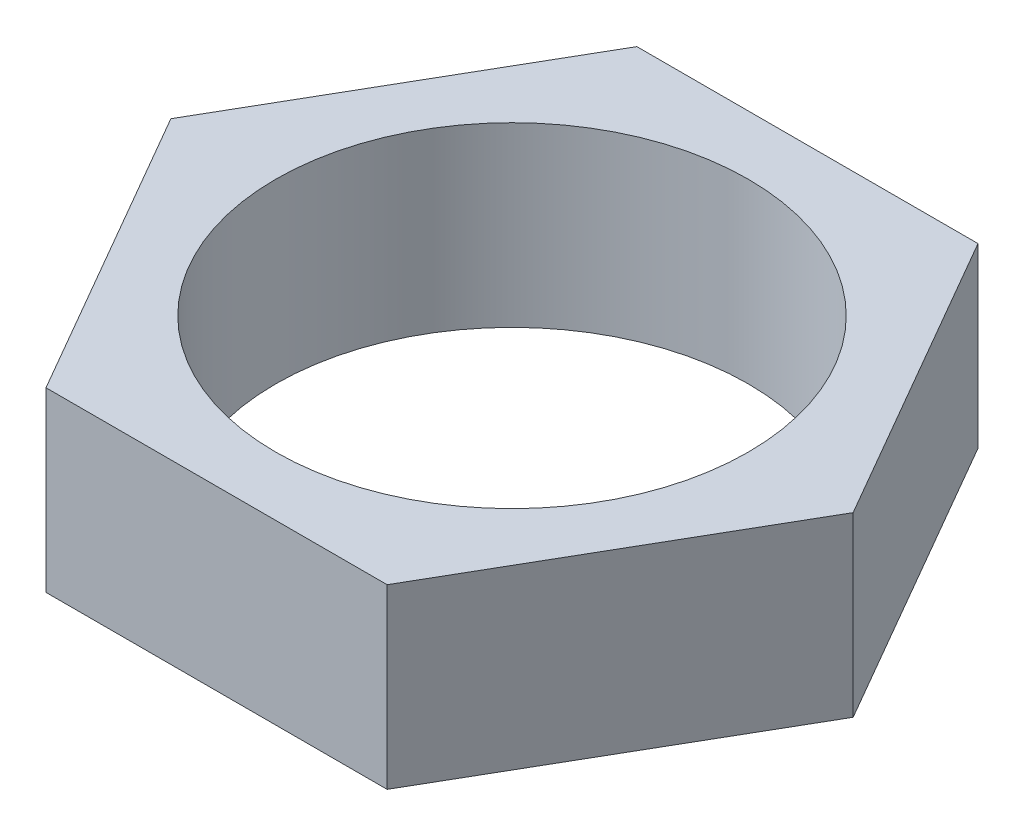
ISO-10303-21;
HEADER;
FILE_DESCRIPTION(('STEP AP214'),'2;1');
FILE_NAME('part.step','',(''),(''),'','','');
FILE_SCHEMA(('AUTOMOTIVE_DESIGN { 1 0 10303 214 1 1 1 1 }'));
ENDSEC;
DATA;
#1=APPLICATION_CONTEXT('core data for automotive mechanical design processes');
#2=APPLICATION_PROTOCOL_DEFINITION('international standard','automotive_design',2000,#1);
#3=PRODUCT_CONTEXT('',#1,'mechanical');
#4=PRODUCT('Part','Part','',(#3));
#5=PRODUCT_RELATED_PRODUCT_CATEGORY('part','',(#4));
#6=PRODUCT_DEFINITION_FORMATION('','',#4);
#7=PRODUCT_DEFINITION_CONTEXT('part definition',#1,'design');
#8=PRODUCT_DEFINITION('design','',#6,#7);
#9=PRODUCT_DEFINITION_SHAPE('','',#8);
#10=(LENGTH_UNIT() NAMED_UNIT(*) SI_UNIT(.MILLI.,.METRE.));
#11=(NAMED_UNIT(*) PLANE_ANGLE_UNIT() SI_UNIT($,.RADIAN.));
#12=(NAMED_UNIT(*) SI_UNIT($,.STERADIAN.) SOLID_ANGLE_UNIT());
#13=UNCERTAINTY_MEASURE_WITH_UNIT(LENGTH_MEASURE(1.E-05),#10,'distance_accuracy_value','');
#14=(GEOMETRIC_REPRESENTATION_CONTEXT(3) GLOBAL_UNCERTAINTY_ASSIGNED_CONTEXT((#13)) GLOBAL_UNIT_ASSIGNED_CONTEXT((#10,
#11,#12)) REPRESENTATION_CONTEXT('',''));
#15=CARTESIAN_POINT('',(0.,0.,0.));
#16=DIRECTION('',(0.,0.,1.));
#17=DIRECTION('',(1.,0.,0.));
#18=AXIS2_PLACEMENT_3D('',#15,#16,#17);
#19=CARTESIAN_POINT('',(2.88675134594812,3.,5.));
#20=DIRECTION('',(0.,1.,0.));
#21=DIRECTION('',(0.,0.,1.));
#22=AXIS2_PLACEMENT_3D('',#19,#20,#21);
#23=PLANE('',#22);
#24=DIRECTION('',(1.,0.,0.));
#25=VECTOR('',#24,1.);
#26=CARTESIAN_POINT('',(-2.88675134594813,3.,5.));
#27=LINE('',#26,#25);
#28=CARTESIAN_POINT('',(-2.88675134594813,3.,5.));
#29=VERTEX_POINT('',#28);
#30=CARTESIAN_POINT('',(2.88675134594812,3.,5.));
#31=VERTEX_POINT('',#30);
#32=EDGE_CURVE('E133',#29,#31,#27,.T.);
#33=ORIENTED_EDGE('',*,*,#32,.T.);
#34=DIRECTION('',(0.5,0.,-0.866025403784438));
#35=VECTOR('',#34,1.);
#36=CARTESIAN_POINT('',(2.88675134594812,3.,5.));
#37=LINE('',#36,#35);
#38=CARTESIAN_POINT('',(5.77350269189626,3.,0.));
#39=VERTEX_POINT('',#38);
#40=EDGE_CURVE('E91',#31,#39,#37,.T.);
#41=ORIENTED_EDGE('',*,*,#40,.T.);
#42=DIRECTION('',(-0.5,0.,-0.866025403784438));
#43=VECTOR('',#42,1.);
#44=CARTESIAN_POINT('',(5.77350269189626,3.,0.));
#45=LINE('',#44,#43);
#46=CARTESIAN_POINT('',(2.88675134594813,3.,-5.));
#47=VERTEX_POINT('',#46);
#48=EDGE_CURVE('E104',#39,#47,#45,.T.);
#49=ORIENTED_EDGE('',*,*,#48,.T.);
#50=DIRECTION('',(-1.,0.,0.));
#51=VECTOR('',#50,1.);
#52=CARTESIAN_POINT('',(2.88675134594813,3.,-5.));
#53=LINE('',#52,#51);
#54=CARTESIAN_POINT('',(-2.88675134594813,3.,-5.));
#55=VERTEX_POINT('',#54);
#56=EDGE_CURVE('E98',#47,#55,#53,.T.);
#57=ORIENTED_EDGE('',*,*,#56,.T.);
#58=DIRECTION('',(-0.5,0.,0.866025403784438));
#59=VECTOR('',#58,1.);
#60=CARTESIAN_POINT('',(-2.88675134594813,3.,-5.));
#61=LINE('',#60,#59);
#62=CARTESIAN_POINT('',(-5.77350269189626,3.,0.));
#63=VERTEX_POINT('',#62);
#64=EDGE_CURVE('E102',#55,#63,#61,.T.);
#65=ORIENTED_EDGE('',*,*,#64,.T.);
#66=DIRECTION('',(0.5,0.,0.866025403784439));
#67=VECTOR('',#66,1.);
#68=CARTESIAN_POINT('',(-5.77350269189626,3.,0.));
#69=LINE('',#68,#67);
#70=EDGE_CURVE('E54',#63,#29,#69,.T.);
#71=ORIENTED_EDGE('',*,*,#70,.T.);
#72=EDGE_LOOP('',(#33,#41,#49,#57,#65,#71));
#73=FACE_BOUND('',#72,.T.);
#74=CARTESIAN_POINT('',(0.,3.,0.));
#75=DIRECTION('',(0.,1.,0.));
#76=DIRECTION('',(0.,0.,1.));
#77=AXIS2_PLACEMENT_3D('',#74,#75,#76);
#78=CIRCLE('',#77,4.);
#79=CARTESIAN_POINT('',(0.,3.,4.));
#80=VERTEX_POINT('',#79);
#81=EDGE_CURVE('E126',#80,#80,#78,.T.);
#82=ORIENTED_EDGE('',*,*,#81,.F.);
#83=EDGE_LOOP('',(#82));
#84=FACE_BOUND('',#83,.T.);
#85=ADVANCED_FACE('F37',(#73,#84),#23,.T.);
#86=CARTESIAN_POINT('',(2.88675134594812,0.,5.));
#87=DIRECTION('',(0.,1.,0.));
#88=DIRECTION('',(0.,0.,1.));
#89=AXIS2_PLACEMENT_3D('',#86,#87,#88);
#90=PLANE('',#89);
#91=DIRECTION('',(1.,0.,0.));
#92=VECTOR('',#91,1.);
#93=CARTESIAN_POINT('',(-2.88675134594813,0.,5.));
#94=LINE('',#93,#92);
#95=CARTESIAN_POINT('',(-2.88675134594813,0.,5.));
#96=VERTEX_POINT('',#95);
#97=CARTESIAN_POINT('',(2.88675134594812,0.,5.));
#98=VERTEX_POINT('',#97);
#99=EDGE_CURVE('E122',#96,#98,#94,.T.);
#100=ORIENTED_EDGE('',*,*,#99,.F.);
#101=DIRECTION('',(0.5,0.,0.866025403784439));
#102=VECTOR('',#101,1.);
#103=CARTESIAN_POINT('',(-5.77350269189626,0.,0.));
#104=LINE('',#103,#102);
#105=CARTESIAN_POINT('',(-5.77350269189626,0.,0.));
#106=VERTEX_POINT('',#105);
#107=EDGE_CURVE('E83',#106,#96,#104,.T.);
#108=ORIENTED_EDGE('',*,*,#107,.F.);
#109=DIRECTION('',(-0.5,0.,0.866025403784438));
#110=VECTOR('',#109,1.);
#111=CARTESIAN_POINT('',(-2.88675134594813,0.,-5.));
#112=LINE('',#111,#110);
#113=CARTESIAN_POINT('',(-2.88675134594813,0.,-5.));
#114=VERTEX_POINT('',#113);
#115=EDGE_CURVE('E77',#114,#106,#112,.T.);
#116=ORIENTED_EDGE('',*,*,#115,.F.);
#117=DIRECTION('',(-1.,0.,0.));
#118=VECTOR('',#117,1.);
#119=CARTESIAN_POINT('',(2.88675134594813,0.,-5.));
#120=LINE('',#119,#118);
#121=CARTESIAN_POINT('',(2.88675134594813,0.,-5.));
#122=VERTEX_POINT('',#121);
#123=EDGE_CURVE('E112',#122,#114,#120,.T.);
#124=ORIENTED_EDGE('',*,*,#123,.F.);
#125=DIRECTION('',(-0.5,0.,-0.866025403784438));
#126=VECTOR('',#125,1.);
#127=CARTESIAN_POINT('',(5.77350269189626,0.,0.));
#128=LINE('',#127,#126);
#129=CARTESIAN_POINT('',(5.77350269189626,0.,0.));
#130=VERTEX_POINT('',#129);
#131=EDGE_CURVE('E128',#130,#122,#128,.T.);
#132=ORIENTED_EDGE('',*,*,#131,.F.);
#133=DIRECTION('',(0.5,0.,-0.866025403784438));
#134=VECTOR('',#133,1.);
#135=CARTESIAN_POINT('',(2.88675134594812,0.,5.));
#136=LINE('',#135,#134);
#137=EDGE_CURVE('E125',#98,#130,#136,.T.);
#138=ORIENTED_EDGE('',*,*,#137,.F.);
#139=EDGE_LOOP('',(#100,#108,#116,#124,#132,#138));
#140=FACE_BOUND('',#139,.T.);
#141=CARTESIAN_POINT('',(0.,0.,0.));
#142=DIRECTION('',(0.,1.,0.));
#143=DIRECTION('',(0.,0.,1.));
#144=AXIS2_PLACEMENT_3D('',#141,#142,#143);
#145=CIRCLE('',#144,4.);
#146=CARTESIAN_POINT('',(0.,0.,4.));
#147=VERTEX_POINT('',#146);
#148=EDGE_CURVE('E226',#147,#147,#145,.T.);
#149=ORIENTED_EDGE('',*,*,#148,.T.);
#150=EDGE_LOOP('',(#149));
#151=FACE_BOUND('',#150,.T.);
#152=ADVANCED_FACE('F142',(#140,#151),#90,.F.);
#153=CARTESIAN_POINT('',(-2.88675134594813,3.,5.));
#154=DIRECTION('',(0.,0.,-1.));
#155=DIRECTION('',(-1.,0.,0.));
#156=AXIS2_PLACEMENT_3D('',#153,#154,#155);
#157=PLANE('',#156);
#158=ORIENTED_EDGE('',*,*,#99,.T.);
#159=DIRECTION('',(0.,-1.,0.));
#160=VECTOR('',#159,1.);
#161=CARTESIAN_POINT('',(2.88675134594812,3.,5.));
#162=LINE('',#161,#160);
#163=EDGE_CURVE('E11',#31,#98,#162,.T.);
#164=ORIENTED_EDGE('',*,*,#163,.F.);
#165=ORIENTED_EDGE('',*,*,#32,.F.);
#166=DIRECTION('',(0.,-1.,0.));
#167=VECTOR('',#166,1.);
#168=CARTESIAN_POINT('',(-2.88675134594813,3.,5.));
#169=LINE('',#168,#167);
#170=EDGE_CURVE('E118',#29,#96,#169,.T.);
#171=ORIENTED_EDGE('',*,*,#170,.T.);
#172=EDGE_LOOP('',(#158,#164,#165,#171));
#173=FACE_BOUND('',#172,.T.);
#174=ADVANCED_FACE('F39',(#173),#157,.F.);
#175=CARTESIAN_POINT('',(2.88675134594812,3.,5.));
#176=DIRECTION('',(-0.866025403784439,0.,-0.5));
#177=DIRECTION('',(-0.5,0.,0.866025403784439));
#178=AXIS2_PLACEMENT_3D('',#175,#176,#177);
#179=PLANE('',#178);
#180=ORIENTED_EDGE('',*,*,#137,.T.);
#181=DIRECTION('',(0.,-1.,0.));
#182=VECTOR('',#181,1.);
#183=CARTESIAN_POINT('',(5.77350269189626,3.,0.));
#184=LINE('',#183,#182);
#185=EDGE_CURVE('E46',#39,#130,#184,.T.);
#186=ORIENTED_EDGE('',*,*,#185,.F.);
#187=ORIENTED_EDGE('',*,*,#40,.F.);
#188=ORIENTED_EDGE('',*,*,#163,.T.);
#189=EDGE_LOOP('',(#180,#186,#187,#188));
#190=FACE_BOUND('',#189,.T.);
#191=ADVANCED_FACE('F167',(#190),#179,.F.);
#192=CARTESIAN_POINT('',(5.77350269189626,3.,0.));
#193=DIRECTION('',(-0.866025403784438,0.,0.5));
#194=DIRECTION('',(0.5,0.,0.866025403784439));
#195=AXIS2_PLACEMENT_3D('',#192,#193,#194);
#196=PLANE('',#195);
#197=ORIENTED_EDGE('',*,*,#131,.T.);
#198=DIRECTION('',(0.,-1.,0.));
#199=VECTOR('',#198,1.);
#200=CARTESIAN_POINT('',(2.88675134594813,3.,-5.));
#201=LINE('',#200,#199);
#202=EDGE_CURVE('E113',#47,#122,#201,.T.);
#203=ORIENTED_EDGE('',*,*,#202,.F.);
#204=ORIENTED_EDGE('',*,*,#48,.F.);
#205=ORIENTED_EDGE('',*,*,#185,.T.);
#206=EDGE_LOOP('',(#197,#203,#204,#205));
#207=FACE_BOUND('',#206,.T.);
#208=ADVANCED_FACE('F139',(#207),#196,.F.);
#209=CARTESIAN_POINT('',(2.88675134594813,3.,-5.));
#210=DIRECTION('',(0.,0.,1.));
#211=DIRECTION('',(1.,0.,0.));
#212=AXIS2_PLACEMENT_3D('',#209,#210,#211);
#213=PLANE('',#212);
#214=ORIENTED_EDGE('',*,*,#123,.T.);
#215=DIRECTION('',(0.,-1.,0.));
#216=VECTOR('',#215,1.);
#217=CARTESIAN_POINT('',(-2.88675134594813,3.,-5.));
#218=LINE('',#217,#216);
#219=EDGE_CURVE('E109',#55,#114,#218,.T.);
#220=ORIENTED_EDGE('',*,*,#219,.F.);
#221=ORIENTED_EDGE('',*,*,#56,.F.);
#222=ORIENTED_EDGE('',*,*,#202,.T.);
#223=EDGE_LOOP('',(#214,#220,#221,#222));
#224=FACE_BOUND('',#223,.T.);
#225=ADVANCED_FACE('F110',(#224),#213,.F.);
#226=CARTESIAN_POINT('',(-2.88675134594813,3.,-5.));
#227=DIRECTION('',(0.866025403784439,0.,0.5));
#228=DIRECTION('',(0.5,0.,-0.866025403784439));
#229=AXIS2_PLACEMENT_3D('',#226,#227,#228);
#230=PLANE('',#229);
#231=ORIENTED_EDGE('',*,*,#115,.T.);
#232=DIRECTION('',(0.,-1.,0.));
#233=VECTOR('',#232,1.);
#234=CARTESIAN_POINT('',(-5.77350269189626,3.,0.));
#235=LINE('',#234,#233);
#236=EDGE_CURVE('E114',#63,#106,#235,.T.);
#237=ORIENTED_EDGE('',*,*,#236,.F.);
#238=ORIENTED_EDGE('',*,*,#64,.F.);
#239=ORIENTED_EDGE('',*,*,#219,.T.);
#240=EDGE_LOOP('',(#231,#237,#238,#239));
#241=FACE_BOUND('',#240,.T.);
#242=ADVANCED_FACE('F116',(#241),#230,.F.);
#243=CARTESIAN_POINT('',(-5.77350269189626,3.,0.));
#244=DIRECTION('',(0.866025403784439,0.,-0.5));
#245=DIRECTION('',(-0.5,0.,-0.866025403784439));
#246=AXIS2_PLACEMENT_3D('',#243,#244,#245);
#247=PLANE('',#246);
#248=ORIENTED_EDGE('',*,*,#107,.T.);
#249=ORIENTED_EDGE('',*,*,#170,.F.);
#250=ORIENTED_EDGE('',*,*,#70,.F.);
#251=ORIENTED_EDGE('',*,*,#236,.T.);
#252=EDGE_LOOP('',(#248,#249,#250,#251));
#253=FACE_BOUND('',#252,.T.);
#254=ADVANCED_FACE('F147',(#253),#247,.F.);
#255=CARTESIAN_POINT('',(0.,3.,0.));
#256=DIRECTION('',(0.,-1.,0.));
#257=DIRECTION('',(0.,0.,-1.));
#258=AXIS2_PLACEMENT_3D('',#255,#256,#257);
#259=CYLINDRICAL_SURFACE('',#258,4.);
#260=ORIENTED_EDGE('',*,*,#81,.T.);
#261=EDGE_LOOP('',(#260));
#262=FACE_BOUND('',#261,.T.);
#263=ORIENTED_EDGE('',*,*,#148,.F.);
#264=EDGE_LOOP('',(#263));
#265=FACE_BOUND('',#264,.T.);
#266=ADVANCED_FACE('F149',(#262,#265),#259,.F.);
#267=CLOSED_SHELL('',(#85,#152,#174,#191,#208,#225,#242,#254,#266));
#268=MANIFOLD_SOLID_BREP('B2',#267);
#269=ADVANCED_BREP_SHAPE_REPRESENTATION('',(#18,#268),#14);
#270=SHAPE_DEFINITION_REPRESENTATION(#9,#269);
ENDSEC;
END-ISO-10303-21;
